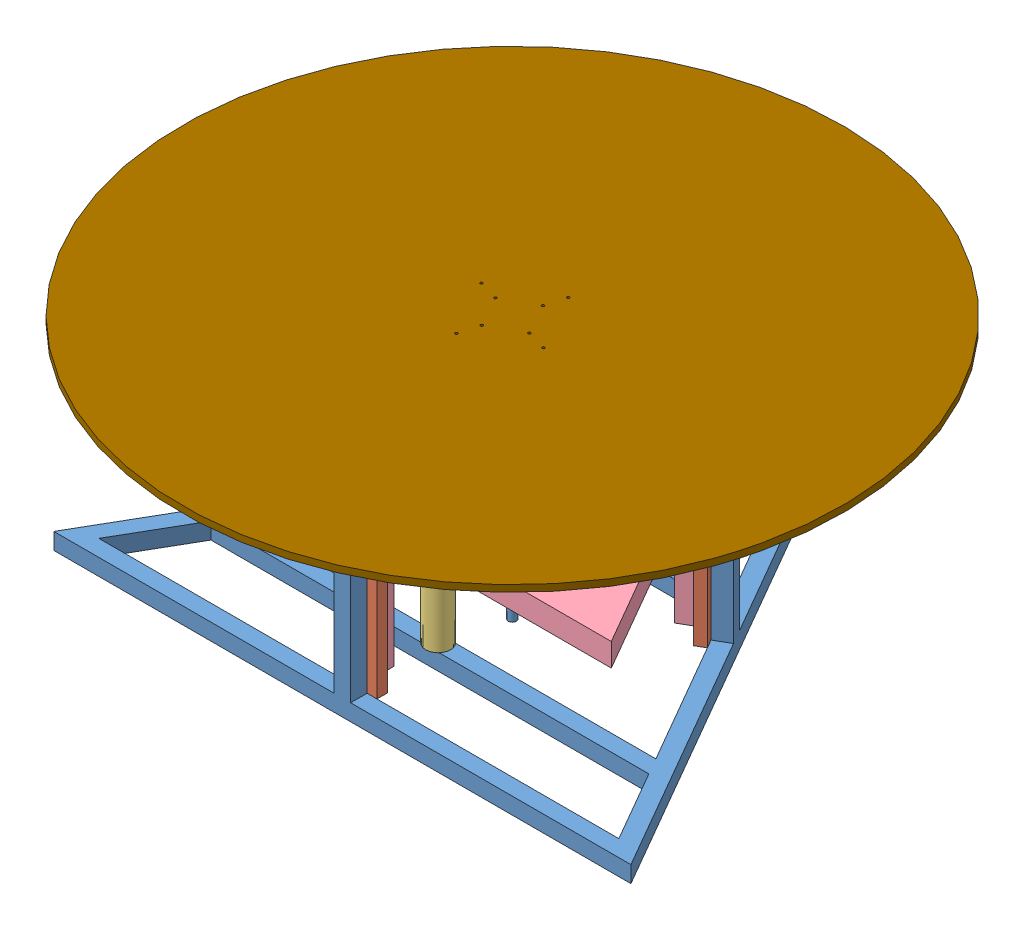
SolidWorks assembly 装配体2.SLDASM, configuration 默认 (file format 14000). Lengths in mm.
Overall size (989.34 318.73 989.34).
12 component instances, 9 part files, 29 mates.
Components (placement in the parent):
- 一级底盘-1: 一级底盘.SLDPRT [默认] at origin size (700 170 606.22)
- 滑块-1: 滑块.SLDPRT [默认] at (135.8542 170 -99.6937) x (0.5 0 0.866025) z (0 1 0) size (44 12.5 150)
- 滑块-2: 滑块.SLDPRT [默认] at (-157.8542 170 -61.5885) x (0.5 0 -0.866025) z (0 1 0) size (44 12.5 150)
- 滑块-3: 滑块.SLDPRT [默认] at (-22 20 173.7178) x (1 0 0) z (0 -1 0) size (44 12.5 150)
- 气缸-1: 气缸.SLDPRT [默认] at (0 0 90) x (0 0 1) z (-1 0 0) size (30 208 30)
- 气缸-2: 气缸.SLDPRT [默认] at (0 0 -130) x (0 0 -1) z (1 0 0) size (30 208 30)
- 二级底盘-1: 二级底盘.SLDPRT [默认] at (0 202 -40) x (-1 0 0) z (0 0 1) size (587.42 178 508.72)
- 大同步轮-1: 大同步轮.SLDPRT [默认] at (0 166 0) x (0.999537 0 -0.030441) z (0.030441 0 0.999537) size (126 26 126)
- 滚针轴承-1: 滚针轴承.SLDPRT [默认] at (0 304.7324 0) size (105 6 105)
- 滚珠轴承-1: 滚珠轴承.SLDPRT [默认] at (0 296.7324 0) x (0.95191 0 -0.306379) z (0.306379 0 0.95191) size (120 8 120)
- 牛眼轮-1: 牛眼轮.SLDPRT [默认] at (118.9109 230 5.91) x (-0.837169 0 -0.546944) z (-0.546944 0 0.837169) size (24 37 24)
- 平台-2: 平台.SLDPRT [默认] at (0 318.7324 0) x (-0.275328 0 0.96135) z (0.96135 0 0.275328) size (800 28 800)
Mates (geometry in assembly coordinates):
- 重合1: coincident anti-aligned: plane of 一级底盘-1 through (254.0341 20 80) normal (-0.866025 0 0.5); plane of 滑块-1 through (146.6795 170 -105.9437) normal (0.866025 0 -0.5)
- 重合3: coincident anti-aligned: plane of 一级底盘-1 through (-138.5641 20 -120) normal (0.866025 0 0.5); plane of 滑块-2 through (-168.6795 170 -67.8385) normal (-0.866025 0 -0.5)
- 重合4: coincident aligned: plane of 一级底盘-1 through (0 170 0) normal (0 1 0); plane of 滑块-2 through (-168.6795 170 -67.8385) normal (0 1 0)
- 宽度2: width aligned: plane of 滑块-2 through (-168.6795 170 -67.8385) normal (-0.5 0 0.866025); plane of 滑块-2 through (-146.6795 170 -105.9437) normal (0.5 0 -0.866025); plane of 一级底盘-1 through (-162.6795 170 -78.2309) normal (-0.5 0 0.866025); plane of 一级底盘-1 through (-152.6795 170 -95.5514) normal (0.5 0 -0.866025)
- 重合5: coincident anti-aligned: plane of 一级底盘-1 through (-315.359 20 186.2178) normal (0 0 -1); plane of 滑块-3 through (-22 20 186.2178) normal (0 0 1)
- 平行2: parallel anti-aligned: plane of 一级底盘-1 through (-265.5811 20 100) normal (0 0 1); plane of 气缸-1 through (7.5498 20 82) normal (0 0 -1)
- 宽度4: width aligned: plane of 一级底盘-1 through (-265.5811 20 100) normal (0 0 1); plane of 一级底盘-1 through (-254.0341 20 80) normal (0 0 -1); plane of 气缸-1 through (7.5498 20 98) normal (0 0 1); plane of 气缸-1 through (7.5498 20 82) normal (0 0 -1)
- 重合7: coincident anti-aligned: plane of 一级底盘-1 through (0 20 0) normal (0 1 0); plane of 气缸-1 through (0 20 90) normal (0 -1 0)
- 平行3: parallel anti-aligned: plane of 一级底盘-1 through (-127.0171 20 -140) normal (0 0 -1); plane of 气缸-2 through (-7.5498 20 -122) normal (0 0 1)
- 宽度5: width aligned: plane of 一级底盘-1 through (-127.0171 20 -140) normal (0 0 -1); plane of 一级底盘-1 through (-138.5641 20 -120) normal (0 0 1); plane of 气缸-2 through (-7.5498 20 -138) normal (0 0 -1); plane of 气缸-2 through (-7.5498 20 -122) normal (0 0 1)
- 重合8: coincident anti-aligned: plane of 一级底盘-1 through (0 20 0) normal (0 1 0); plane of 气缸-2 through (0 20 -130) normal (0 -1 0)
- 重合9: coincident aligned: plane of 一级底盘-1 through (0 170 0) normal (0 1 0); plane of 滑块-3 through (-22 170 186.2178) normal (0 1 0)
- 重合10: coincident aligned: plane of 一级底盘-1 through (0 170 0) normal (0 1 0); plane of 滑块-1 through (146.6795 170 -105.9437) normal (0 1 0)
- 宽度6: width aligned: plane of 滑块-1 through (168.6795 170 -67.8385) normal (0.5 0 0.866025); plane of 滑块-1 through (146.6795 170 -105.9437) normal (-0.5 0 -0.866025); plane of 一级底盘-1 through (180 170 -88.2309) normal (0.5 0 0.866025); plane of 一级底盘-1 through (170 170 -105.5514) normal (-0.5 0 -0.866025)
- 平行4: parallel anti-aligned: plane of 一级底盘-1 through (0 20 0) normal (0 1 0); plane of 二级底盘-1 through (0 182 -40) normal (0 -1 0)
- 平行5: parallel aligned: plane of 一级底盘-1 through (0 20 -400) normal (-0.866025 0 -0.5); plane of 二级底盘-1 through (-293.7083 182 173.7178) normal (-0.866025 0 -0.5)
- 重合11: coincident anti-aligned: plane of 滑块-2 through (-157.8542 170 -61.5885) normal (0.866025 0 0.5); plane of 二级底盘-1 through (-293.7083 182 173.7178) normal (-0.866025 0 -0.5)
- 重合12: coincident anti-aligned: plane of 滑块-3 through (-22 20 173.7178) normal (0 0 -1); plane of 二级底盘-1 through (293.7083 182 173.7178) normal (0 0 1)
- 同心1: concentric anti-aligned: cylinder of 气缸-2 through (0 208 -130) axis (0 -1 0) radius 3.5; cylinder of 二级底盘-1 through (0 182 -130) axis (0 1 0) radius 4
- 同心2: concentric anti-aligned: cylinder of 气缸-1 through (0 208 90) axis (0 -1 0) radius 3.5; cylinder of 二级底盘-1 through (0 182 90) axis (0 1 0) radius 4
- 重合13: coincident anti-aligned: plane of 气缸-1 through (0 182 90) normal (0 1 0); plane of 二级底盘-1 through (0 182 -40) normal (0 -1 0)
- 同心3: concentric anti-aligned: cylinder of 一级底盘-1 through (0 0 0) axis (0 1 0) radius 5; cylinder of 大同步轮-1 through (0 192 0) axis (0 -1 0) radius 26
- 同心4: concentric aligned: cylinder of 大同步轮-1 through (0 192 0) axis (0 -1 0) radius 26; cylinder of 滚针轴承-1 through (0 310.7324 0) axis (0 -1 0) radius 40
- 同心5: concentric aligned: cylinder of 大同步轮-1 through (0 192 0) axis (0 -1 0) radius 26; cylinder of 滚珠轴承-1 through (0 304.7324 0) axis (0 -1 0) radius 40
- 重合14: coincident anti-aligned: plane of 滚针轴承-1 through (0 304.7324 0) normal (0 -1 0); plane of 滚珠轴承-1 through (0 304.7324 0) normal (0 1 0)
- 重合16: coincident anti-aligned: plane of 二级底盘-1 through (0 210 -40) normal (0 1 0); plane of 牛眼轮-1 through (118.9109 210 5.91) normal (0 -1 0)
- 重合19: coincident anti-aligned: plane of 二级底盘-1 through (0 182 -40) normal (0 -1 0); plane of 大同步轮-1 through (0 182 0) normal (0 1 0)
- 同心9: concentric anti-aligned: cylinder of 滚珠轴承-1 through (0 304.7324 0) axis (0 -1 0) radius 60; cylinder of 平台-2 through (0 310.7324 0) axis (0 1 0) radius 400
- 重合20: coincident anti-aligned: plane of 滚针轴承-1 through (0 310.7324 0) normal (0 1 0); plane of 平台-2 through (0 310.7324 0) normal (0 -1 0)
